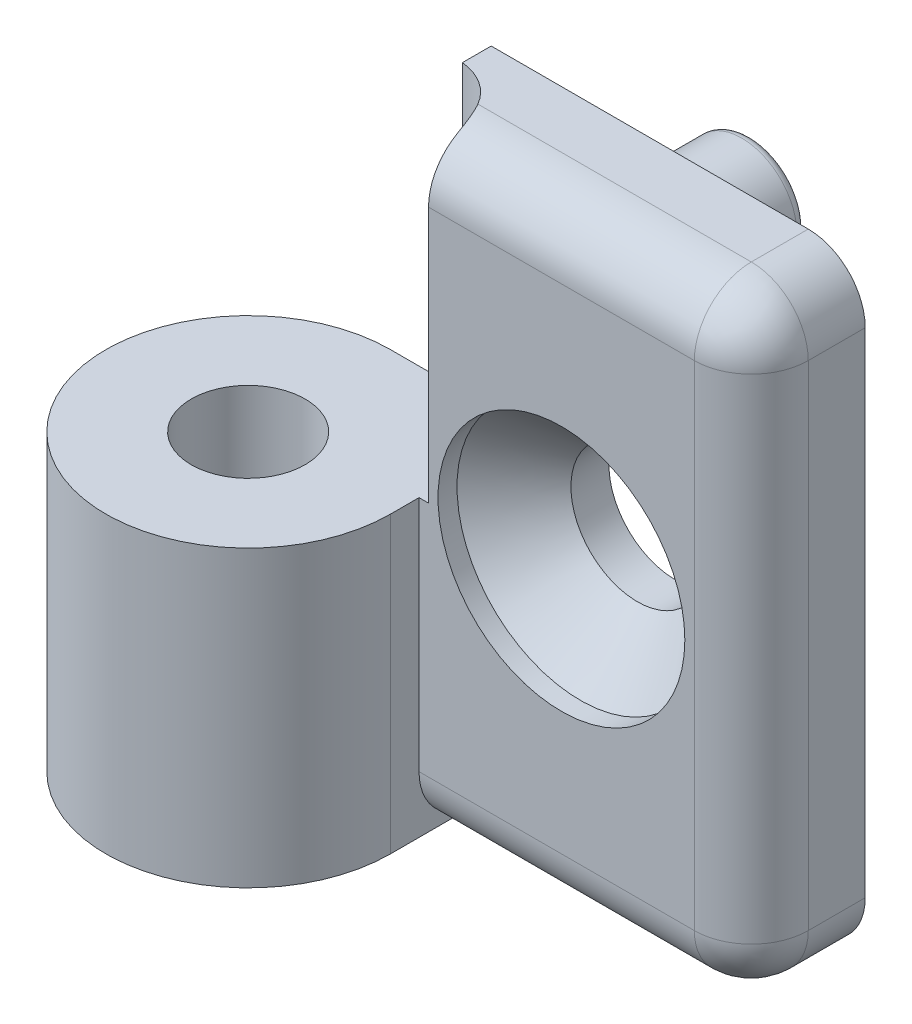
ISO-10303-21;
HEADER;
FILE_DESCRIPTION(('STEP AP214'),'2;1');
FILE_NAME('part.step','',(''),(''),'','','');
FILE_SCHEMA(('AUTOMOTIVE_DESIGN { 1 0 10303 214 1 1 1 1 }'));
ENDSEC;
DATA;
#1=APPLICATION_CONTEXT('core data for automotive mechanical design processes');
#2=APPLICATION_PROTOCOL_DEFINITION('international standard','automotive_design',2000,#1);
#3=PRODUCT_CONTEXT('',#1,'mechanical');
#4=PRODUCT('Part','Part','',(#3));
#5=PRODUCT_RELATED_PRODUCT_CATEGORY('part','',(#4));
#6=PRODUCT_DEFINITION_FORMATION('','',#4);
#7=PRODUCT_DEFINITION_CONTEXT('part definition',#1,'design');
#8=PRODUCT_DEFINITION('design','',#6,#7);
#9=PRODUCT_DEFINITION_SHAPE('','',#8);
#10=(LENGTH_UNIT() NAMED_UNIT(*) SI_UNIT(.MILLI.,.METRE.));
#11=(NAMED_UNIT(*) PLANE_ANGLE_UNIT() SI_UNIT($,.RADIAN.));
#12=(NAMED_UNIT(*) SI_UNIT($,.STERADIAN.) SOLID_ANGLE_UNIT());
#13=UNCERTAINTY_MEASURE_WITH_UNIT(LENGTH_MEASURE(1.E-05),#10,'distance_accuracy_value','');
#14=(GEOMETRIC_REPRESENTATION_CONTEXT(3) GLOBAL_UNCERTAINTY_ASSIGNED_CONTEXT((#13)) GLOBAL_UNIT_ASSIGNED_CONTEXT((#10,
#11,#12)) REPRESENTATION_CONTEXT('',''));
#15=CARTESIAN_POINT('',(0.,0.,0.));
#16=DIRECTION('',(0.,0.,1.));
#17=DIRECTION('',(1.,0.,0.));
#18=AXIS2_PLACEMENT_3D('',#15,#16,#17);
#19=CARTESIAN_POINT('',(7.59999999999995,15.5,-7.49999999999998));
#20=DIRECTION('',(0.,0.,1.));
#21=DIRECTION('',(1.,0.,0.));
#22=AXIS2_PLACEMENT_3D('',#19,#20,#21);
#23=PLANE('',#22);
#24=CARTESIAN_POINT('',(15.0000000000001,4.,-7.49999999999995));
#25=DIRECTION('',(0.,0.,1.));
#26=DIRECTION('',(1.,0.,0.));
#27=AXIS2_PLACEMENT_3D('',#24,#25,#26);
#28=CIRCLE('',#27,2.9);
#29=CARTESIAN_POINT('',(17.9000000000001,4.,-7.49999999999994));
#30=VERTEX_POINT('',#29);
#31=EDGE_CURVE('E262',#30,#30,#28,.F.);
#32=ORIENTED_EDGE('',*,*,#31,.F.);
#33=EDGE_LOOP('',(#32));
#34=FACE_BOUND('',#33,.T.);
#35=CARTESIAN_POINT('',(15.0000000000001,16.,-7.49999999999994));
#36=DIRECTION('',(0.,0.,1.));
#37=DIRECTION('',(1.,0.,0.));
#38=AXIS2_PLACEMENT_3D('',#35,#36,#37);
#39=CIRCLE('',#38,3.5);
#40=CARTESIAN_POINT('',(18.5000000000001,16.,-7.49999999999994));
#41=VERTEX_POINT('',#40);
#42=EDGE_CURVE('E171',#41,#41,#39,.T.);
#43=ORIENTED_EDGE('',*,*,#42,.T.);
#44=EDGE_LOOP('',(#43));
#45=FACE_BOUND('',#44,.T.);
#46=DIRECTION('',(0.,-1.,0.));
#47=VECTOR('',#46,1.);
#48=CARTESIAN_POINT('',(25.0000000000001,32.,-7.49999999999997));
#49=LINE('',#48,#47);
#50=CARTESIAN_POINT('',(25.0000000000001,29.,-7.49999999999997));
#51=VERTEX_POINT('',#50);
#52=CARTESIAN_POINT('',(25.0000000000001,3.,-7.49999999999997));
#53=VERTEX_POINT('',#52);
#54=EDGE_CURVE('E180',#51,#53,#49,.T.);
#55=ORIENTED_EDGE('',*,*,#54,.T.);
#56=CARTESIAN_POINT('',(22.0000000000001,3.,-7.49999999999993));
#57=DIRECTION('',(0.,0.,1.));
#58=DIRECTION('',(1.,0.,0.));
#59=AXIS2_PLACEMENT_3D('',#56,#57,#58);
#60=CIRCLE('',#59,3.);
#61=CARTESIAN_POINT('',(22.0000000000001,0.,-7.49999999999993));
#62=VERTEX_POINT('',#61);
#63=EDGE_CURVE('E222',#53,#62,#60,.F.);
#64=ORIENTED_EDGE('',*,*,#63,.T.);
#65=DIRECTION('',(-1.,0.,0.));
#66=VECTOR('',#65,1.);
#67=CARTESIAN_POINT('',(7.59999999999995,0.,-7.49999999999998));
#68=LINE('',#67,#66);
#69=CARTESIAN_POINT('',(0.,0.,-7.50000000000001));
#70=VERTEX_POINT('',#69);
#71=EDGE_CURVE('E198',#62,#70,#68,.T.);
#72=ORIENTED_EDGE('',*,*,#71,.T.);
#73=DIRECTION('',(0.,-1.,0.));
#74=VECTOR('',#73,1.);
#75=CARTESIAN_POINT('',(0.,15.5,-7.50000000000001));
#76=LINE('',#75,#74);
#77=CARTESIAN_POINT('',(0.,15.5,-7.50000000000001));
#78=VERTEX_POINT('',#77);
#79=EDGE_CURVE('E202',#78,#70,#76,.T.);
#80=ORIENTED_EDGE('',*,*,#79,.F.);
#81=DIRECTION('',(-1.,0.,0.));
#82=VECTOR('',#81,1.);
#83=CARTESIAN_POINT('',(7.59999999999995,15.5,-7.49999999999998));
#84=LINE('',#83,#82);
#85=CARTESIAN_POINT('',(5.30000000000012,15.5,-7.49999999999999));
#86=VERTEX_POINT('',#85);
#87=EDGE_CURVE('E200',#86,#78,#84,.T.);
#88=ORIENTED_EDGE('',*,*,#87,.F.);
#89=DIRECTION('',(0.,-1.,0.));
#90=VECTOR('',#89,1.);
#91=CARTESIAN_POINT('',(5.30000000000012,32.,-7.49999999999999));
#92=LINE('',#91,#90);
#93=CARTESIAN_POINT('',(5.30000000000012,32.,-7.49999999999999));
#94=VERTEX_POINT('',#93);
#95=EDGE_CURVE('E184',#94,#86,#92,.T.);
#96=ORIENTED_EDGE('',*,*,#95,.F.);
#97=DIRECTION('',(-1.,0.,0.));
#98=VECTOR('',#97,1.);
#99=CARTESIAN_POINT('',(0.,32.,-7.49999999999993));
#100=LINE('',#99,#98);
#101=CARTESIAN_POINT('',(22.0000000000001,32.,-7.49999999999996));
#102=VERTEX_POINT('',#101);
#103=EDGE_CURVE('E176',#102,#94,#100,.T.);
#104=ORIENTED_EDGE('',*,*,#103,.F.);
#105=CARTESIAN_POINT('',(22.0000000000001,29.,-7.49999999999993));
#106=DIRECTION('',(0.,0.,1.));
#107=DIRECTION('',(1.,0.,0.));
#108=AXIS2_PLACEMENT_3D('',#105,#106,#107);
#109=CIRCLE('',#108,3.);
#110=EDGE_CURVE('E220',#102,#51,#109,.F.);
#111=ORIENTED_EDGE('',*,*,#110,.T.);
#112=EDGE_LOOP('',(#55,#64,#72,#80,#88,#96,#104,#111));
#113=FACE_BOUND('',#112,.T.);
#114=CARTESIAN_POINT('',(15.0000000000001,28.,-7.49999999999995));
#115=DIRECTION('',(0.,0.,1.));
#116=DIRECTION('',(1.,0.,0.));
#117=AXIS2_PLACEMENT_3D('',#114,#115,#116);
#118=CIRCLE('',#117,2.9);
#119=CARTESIAN_POINT('',(17.9000000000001,28.,-7.49999999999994));
#120=VERTEX_POINT('',#119);
#121=EDGE_CURVE('E376',#120,#120,#118,.F.);
#122=ORIENTED_EDGE('',*,*,#121,.F.);
#123=EDGE_LOOP('',(#122));
#124=FACE_BOUND('',#123,.T.);
#125=ADVANCED_FACE('F34',(#34,#45,#113,#124),#23,.F.);
#126=CARTESIAN_POINT('',(0.,15.5,0.));
#127=DIRECTION('',(0.,-1.,0.));
#128=DIRECTION('',(0.,0.,-1.));
#129=AXIS2_PLACEMENT_3D('',#126,#127,#128);
#130=CYLINDRICAL_SURFACE('',#129,7.49999999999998);
#131=CARTESIAN_POINT('',(0.,0.,0.));
#132=DIRECTION('',(0.,1.,0.));
#133=DIRECTION('',(0.,0.,1.));
#134=AXIS2_PLACEMENT_3D('',#131,#132,#133);
#135=CIRCLE('',#134,7.49999999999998);
#136=CARTESIAN_POINT('',(7.49999999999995,0.,0.));
#137=VERTEX_POINT('',#136);
#138=EDGE_CURVE('E193',#70,#137,#135,.T.);
#139=ORIENTED_EDGE('',*,*,#138,.T.);
#140=DIRECTION('',(0.,-1.,0.));
#141=VECTOR('',#140,1.);
#142=CARTESIAN_POINT('',(7.49999999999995,15.5,0.));
#143=LINE('',#142,#141);
#144=CARTESIAN_POINT('',(7.49999999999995,15.5,0.));
#145=VERTEX_POINT('',#144);
#146=EDGE_CURVE('E212',#145,#137,#143,.T.);
#147=ORIENTED_EDGE('',*,*,#146,.F.);
#148=CARTESIAN_POINT('',(0.,15.5,0.));
#149=DIRECTION('',(0.,1.,0.));
#150=DIRECTION('',(0.,0.,1.));
#151=AXIS2_PLACEMENT_3D('',#148,#149,#150);
#152=CIRCLE('',#151,7.49999999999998);
#153=EDGE_CURVE('E194',#78,#145,#152,.T.);
#154=ORIENTED_EDGE('',*,*,#153,.F.);
#155=ORIENTED_EDGE('',*,*,#79,.T.);
#156=EDGE_LOOP('',(#139,#147,#154,#155));
#157=FACE_BOUND('',#156,.T.);
#158=ADVANCED_FACE('F312',(#157),#130,.T.);
#159=CARTESIAN_POINT('',(7.49999999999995,15.5,0.));
#160=DIRECTION('',(-1.,0.,0.));
#161=DIRECTION('',(0.,0.,1.));
#162=AXIS2_PLACEMENT_3D('',#159,#160,#161);
#163=PLANE('',#162);
#164=DIRECTION('',(0.,0.,-1.));
#165=VECTOR('',#164,1.);
#166=CARTESIAN_POINT('',(7.49999999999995,0.,0.));
#167=LINE('',#166,#165);
#168=CARTESIAN_POINT('',(7.49999999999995,0.,-4.49999999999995));
#169=VERTEX_POINT('',#168);
#170=EDGE_CURVE('E205',#137,#169,#167,.T.);
#171=ORIENTED_EDGE('',*,*,#170,.T.);
#172=CARTESIAN_POINT('',(7.49999999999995,3.,-4.49999999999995));
#173=DIRECTION('',(-1.,0.,0.));
#174=DIRECTION('',(0.,0.,1.));
#175=AXIS2_PLACEMENT_3D('',#172,#173,#174);
#176=CIRCLE('',#175,3.);
#177=CARTESIAN_POINT('',(7.49999999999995,3.,-1.49999999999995));
#178=VERTEX_POINT('',#177);
#179=EDGE_CURVE('E57',#169,#178,#176,.T.);
#180=ORIENTED_EDGE('',*,*,#179,.T.);
#181=DIRECTION('',(0.,-1.,0.));
#182=VECTOR('',#181,1.);
#183=CARTESIAN_POINT('',(7.49999999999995,15.5,-1.49999999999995));
#184=LINE('',#183,#182);
#185=CARTESIAN_POINT('',(7.49999999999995,15.5,-1.49999999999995));
#186=VERTEX_POINT('',#185);
#187=EDGE_CURVE('E210',#186,#178,#184,.T.);
#188=ORIENTED_EDGE('',*,*,#187,.F.);
#189=DIRECTION('',(0.,0.,-1.));
#190=VECTOR('',#189,1.);
#191=CARTESIAN_POINT('',(7.49999999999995,15.5,0.));
#192=LINE('',#191,#190);
#193=EDGE_CURVE('E197',#145,#186,#192,.T.);
#194=ORIENTED_EDGE('',*,*,#193,.F.);
#195=ORIENTED_EDGE('',*,*,#146,.T.);
#196=EDGE_LOOP('',(#171,#180,#188,#194,#195));
#197=FACE_BOUND('',#196,.T.);
#198=ADVANCED_FACE('F316',(#197),#163,.F.);
#199=CARTESIAN_POINT('',(7.59999999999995,15.5,-1.49999999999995));
#200=DIRECTION('',(0.,0.,-1.));
#201=DIRECTION('',(-1.,0.,0.));
#202=AXIS2_PLACEMENT_3D('',#199,#200,#201);
#203=PLANE('',#202);
#204=CARTESIAN_POINT('',(15.0000000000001,16.,-1.49999999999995));
#205=DIRECTION('',(0.,0.,1.));
#206=DIRECTION('',(1.,0.,0.));
#207=AXIS2_PLACEMENT_3D('',#204,#205,#206);
#208=CIRCLE('',#207,6.5);
#209=CARTESIAN_POINT('',(21.5000000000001,16.,-1.49999999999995));
#210=VERTEX_POINT('',#209);
#211=EDGE_CURVE('E161',#210,#210,#208,.T.);
#212=ORIENTED_EDGE('',*,*,#211,.F.);
#213=EDGE_LOOP('',(#212));
#214=FACE_BOUND('',#213,.T.);
#215=DIRECTION('',(-1.,0.,0.));
#216=VECTOR('',#215,1.);
#217=CARTESIAN_POINT('',(7.59999999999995,29.,-1.49999999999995));
#218=LINE('',#217,#216);
#219=CARTESIAN_POINT('',(22.0000000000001,29.,-1.49999999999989));
#220=VERTEX_POINT('',#219);
#221=CARTESIAN_POINT('',(8.00000000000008,29.,-1.49999999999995));
#222=VERTEX_POINT('',#221);
#223=EDGE_CURVE('E238',#220,#222,#218,.T.);
#224=ORIENTED_EDGE('',*,*,#223,.T.);
#225=DIRECTION('',(0.,-1.,0.));
#226=VECTOR('',#225,1.);
#227=CARTESIAN_POINT('',(8.00000000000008,15.5,-1.49999999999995));
#228=LINE('',#227,#226);
#229=CARTESIAN_POINT('',(8.00000000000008,15.5,-1.49999999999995));
#230=VERTEX_POINT('',#229);
#231=EDGE_CURVE('E49',#222,#230,#228,.T.);
#232=ORIENTED_EDGE('',*,*,#231,.T.);
#233=DIRECTION('',(1.,0.,0.));
#234=VECTOR('',#233,1.);
#235=CARTESIAN_POINT('',(7.59999999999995,15.5,-1.49999999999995));
#236=LINE('',#235,#234);
#237=EDGE_CURVE('E137',#186,#230,#236,.T.);
#238=ORIENTED_EDGE('',*,*,#237,.F.);
#239=ORIENTED_EDGE('',*,*,#187,.T.);
#240=DIRECTION('',(1.,0.,0.));
#241=VECTOR('',#240,1.);
#242=CARTESIAN_POINT('',(7.59999999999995,3.,-1.49999999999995));
#243=LINE('',#242,#241);
#244=CARTESIAN_POINT('',(22.0000000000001,3.,-1.49999999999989));
#245=VERTEX_POINT('',#244);
#246=EDGE_CURVE('E241',#178,#245,#243,.T.);
#247=ORIENTED_EDGE('',*,*,#246,.T.);
#248=DIRECTION('',(0.,-1.,0.));
#249=VECTOR('',#248,1.);
#250=CARTESIAN_POINT('',(22.0000000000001,32.,-1.49999999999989));
#251=LINE('',#250,#249);
#252=EDGE_CURVE('E187',#220,#245,#251,.T.);
#253=ORIENTED_EDGE('',*,*,#252,.F.);
#254=EDGE_LOOP('',(#224,#232,#238,#239,#247,#253));
#255=FACE_BOUND('',#254,.T.);
#256=ADVANCED_FACE('F305',(#214,#255),#203,.F.);
#257=CARTESIAN_POINT('',(0.,15.5,0.));
#258=DIRECTION('',(0.,1.,0.));
#259=DIRECTION('',(0.,0.,1.));
#260=AXIS2_PLACEMENT_3D('',#257,#258,#259);
#261=PLANE('',#260);
#262=CARTESIAN_POINT('',(0.,15.5,0.));
#263=DIRECTION('',(0.,1.,0.));
#264=DIRECTION('',(0.,0.,1.));
#265=AXIS2_PLACEMENT_3D('',#262,#263,#264);
#266=CIRCLE('',#265,3.);
#267=CARTESIAN_POINT('',(0.,15.5,3.));
#268=VERTEX_POINT('',#267);
#269=EDGE_CURVE('E154',#268,#268,#266,.T.);
#270=ORIENTED_EDGE('',*,*,#269,.F.);
#271=EDGE_LOOP('',(#270));
#272=FACE_BOUND('',#271,.T.);
#273=ORIENTED_EDGE('',*,*,#193,.T.);
#274=ORIENTED_EDGE('',*,*,#237,.T.);
#275=DIRECTION('',(0.,0.,-1.));
#276=VECTOR('',#275,1.);
#277=CARTESIAN_POINT('',(8.00000000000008,15.5,-2.99999999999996));
#278=LINE('',#277,#276);
#279=CARTESIAN_POINT('',(8.00000000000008,15.5,-2.99999999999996));
#280=VERTEX_POINT('',#279);
#281=EDGE_CURVE('E130',#230,#280,#278,.T.);
#282=ORIENTED_EDGE('',*,*,#281,.T.);
#283=CARTESIAN_POINT('',(5.00000000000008,15.5,-2.99999999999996));
#284=DIRECTION('',(0.,1.,0.));
#285=DIRECTION('',(0.,0.,1.));
#286=AXIS2_PLACEMENT_3D('',#283,#284,#285);
#287=CIRCLE('',#286,3.);
#288=CARTESIAN_POINT('',(5.30000000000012,15.5,-5.98496231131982));
#289=VERTEX_POINT('',#288);
#290=EDGE_CURVE('E135',#280,#289,#287,.T.);
#291=ORIENTED_EDGE('',*,*,#290,.T.);
#292=DIRECTION('',(0.,0.,1.));
#293=VECTOR('',#292,1.);
#294=CARTESIAN_POINT('',(5.30000000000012,15.5,0.));
#295=LINE('',#294,#293);
#296=EDGE_CURVE('E183',#86,#289,#295,.T.);
#297=ORIENTED_EDGE('',*,*,#296,.F.);
#298=ORIENTED_EDGE('',*,*,#87,.T.);
#299=ORIENTED_EDGE('',*,*,#153,.T.);
#300=EDGE_LOOP('',(#273,#274,#282,#291,#297,#298,#299));
#301=FACE_BOUND('',#300,.T.);
#302=ADVANCED_FACE('F133',(#272,#301),#261,.T.);
#303=CARTESIAN_POINT('',(0.,0.,0.));
#304=DIRECTION('',(0.,1.,0.));
#305=DIRECTION('',(0.,0.,1.));
#306=AXIS2_PLACEMENT_3D('',#303,#304,#305);
#307=PLANE('',#306);
#308=ORIENTED_EDGE('',*,*,#71,.F.);
#309=DIRECTION('',(0.,0.,-1.));
#310=VECTOR('',#309,1.);
#311=CARTESIAN_POINT('',(22.0000000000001,0.,0.));
#312=LINE('',#311,#310);
#313=CARTESIAN_POINT('',(22.0000000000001,0.,-4.49999999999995));
#314=VERTEX_POINT('',#313);
#315=EDGE_CURVE('E227',#62,#314,#312,.F.);
#316=ORIENTED_EDGE('',*,*,#315,.T.);
#317=DIRECTION('',(1.,0.,0.));
#318=VECTOR('',#317,1.);
#319=CARTESIAN_POINT('',(0.,0.,-4.49999999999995));
#320=LINE('',#319,#318);
#321=EDGE_CURVE('E224',#314,#169,#320,.F.);
#322=ORIENTED_EDGE('',*,*,#321,.T.);
#323=ORIENTED_EDGE('',*,*,#170,.F.);
#324=ORIENTED_EDGE('',*,*,#138,.F.);
#325=EDGE_LOOP('',(#308,#316,#322,#323,#324));
#326=FACE_BOUND('',#325,.T.);
#327=ADVANCED_FACE('F301',(#326),#307,.F.);
#328=CARTESIAN_POINT('',(25.0000000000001,32.,0.));
#329=DIRECTION('',(-1.,0.,0.));
#330=DIRECTION('',(0.,0.,1.));
#331=AXIS2_PLACEMENT_3D('',#328,#329,#330);
#332=PLANE('',#331);
#333=DIRECTION('',(0.,-1.,0.));
#334=VECTOR('',#333,1.);
#335=CARTESIAN_POINT('',(25.0000000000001,32.,-4.49999999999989));
#336=LINE('',#335,#334);
#337=CARTESIAN_POINT('',(25.0000000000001,29.,-4.49999999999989));
#338=VERTEX_POINT('',#337);
#339=CARTESIAN_POINT('',(25.0000000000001,3.,-4.49999999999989));
#340=VERTEX_POINT('',#339);
#341=EDGE_CURVE('E179',#338,#340,#336,.T.);
#342=ORIENTED_EDGE('',*,*,#341,.T.);
#343=DIRECTION('',(0.,0.,-1.));
#344=VECTOR('',#343,1.);
#345=CARTESIAN_POINT('',(25.0000000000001,3.,0.));
#346=LINE('',#345,#344);
#347=EDGE_CURVE('E217',#340,#53,#346,.T.);
#348=ORIENTED_EDGE('',*,*,#347,.T.);
#349=ORIENTED_EDGE('',*,*,#54,.F.);
#350=DIRECTION('',(0.,0.,-1.));
#351=VECTOR('',#350,1.);
#352=CARTESIAN_POINT('',(25.0000000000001,29.,0.));
#353=LINE('',#352,#351);
#354=EDGE_CURVE('E215',#51,#338,#353,.F.);
#355=ORIENTED_EDGE('',*,*,#354,.T.);
#356=EDGE_LOOP('',(#342,#348,#349,#355));
#357=FACE_BOUND('',#356,.T.);
#358=ADVANCED_FACE('F294',(#357),#332,.F.);
#359=CARTESIAN_POINT('',(5.30000000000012,32.,0.));
#360=DIRECTION('',(-1.,0.,0.));
#361=DIRECTION('',(0.,0.,1.));
#362=AXIS2_PLACEMENT_3D('',#359,#360,#361);
#363=PLANE('',#362);
#364=DIRECTION('',(0.,1.,0.));
#365=VECTOR('',#364,1.);
#366=CARTESIAN_POINT('',(5.30000000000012,15.5,-5.98496231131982));
#367=LINE('',#366,#365);
#368=CARTESIAN_POINT('',(5.30000000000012,32.,-5.98496231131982));
#369=VERTEX_POINT('',#368);
#370=EDGE_CURVE('E148',#369,#289,#367,.F.);
#371=ORIENTED_EDGE('',*,*,#370,.F.);
#372=DIRECTION('',(0.,0.,-1.));
#373=VECTOR('',#372,1.);
#374=CARTESIAN_POINT('',(5.30000000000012,32.,0.));
#375=LINE('',#374,#373);
#376=EDGE_CURVE('E174',#369,#94,#375,.T.);
#377=ORIENTED_EDGE('',*,*,#376,.T.);
#378=ORIENTED_EDGE('',*,*,#95,.T.);
#379=ORIENTED_EDGE('',*,*,#296,.T.);
#380=EDGE_LOOP('',(#371,#377,#378,#379));
#381=FACE_BOUND('',#380,.T.);
#382=ADVANCED_FACE('F291',(#381),#363,.T.);
#383=CARTESIAN_POINT('',(22.0000000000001,32.,-4.49999999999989));
#384=DIRECTION('',(0.,-1.,0.));
#385=DIRECTION('',(0.,0.,-1.));
#386=AXIS2_PLACEMENT_3D('',#383,#384,#385);
#387=CYLINDRICAL_SURFACE('',#386,3.);
#388=ORIENTED_EDGE('',*,*,#252,.T.);
#389=CARTESIAN_POINT('',(22.0000000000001,3.,-4.49999999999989));
#390=DIRECTION('',(0.,-1.,0.));
#391=DIRECTION('',(0.,0.,-1.));
#392=AXIS2_PLACEMENT_3D('',#389,#390,#391);
#393=CIRCLE('',#392,3.);
#394=EDGE_CURVE('E231',#245,#340,#393,.F.);
#395=ORIENTED_EDGE('',*,*,#394,.T.);
#396=ORIENTED_EDGE('',*,*,#341,.F.);
#397=CARTESIAN_POINT('',(22.0000000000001,29.,-4.49999999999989));
#398=DIRECTION('',(0.,-1.,0.));
#399=DIRECTION('',(0.,0.,-1.));
#400=AXIS2_PLACEMENT_3D('',#397,#398,#399);
#401=CIRCLE('',#400,3.);
#402=EDGE_CURVE('E229',#338,#220,#401,.T.);
#403=ORIENTED_EDGE('',*,*,#402,.T.);
#404=EDGE_LOOP('',(#388,#395,#396,#403));
#405=FACE_BOUND('',#404,.T.);
#406=ADVANCED_FACE('F289',(#405),#387,.T.);
#407=CARTESIAN_POINT('',(0.,32.,0.));
#408=DIRECTION('',(0.,-1.,0.));
#409=DIRECTION('',(0.,0.,-1.));
#410=AXIS2_PLACEMENT_3D('',#407,#408,#409);
#411=PLANE('',#410);
#412=ORIENTED_EDGE('',*,*,#376,.F.);
#413=CARTESIAN_POINT('',(5.00000000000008,32.,-2.99999999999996));
#414=DIRECTION('',(0.,1.,0.));
#415=DIRECTION('',(0.,0.,1.));
#416=AXIS2_PLACEMENT_3D('',#413,#414,#415);
#417=CIRCLE('',#416,3.);
#418=CARTESIAN_POINT('',(7.5980762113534,32.,-4.49999999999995));
#419=VERTEX_POINT('',#418);
#420=EDGE_CURVE('E149',#419,#369,#417,.T.);
#421=ORIENTED_EDGE('',*,*,#420,.F.);
#422=DIRECTION('',(-1.,0.,0.));
#423=VECTOR('',#422,1.);
#424=CARTESIAN_POINT('',(0.,32.,-4.49999999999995));
#425=LINE('',#424,#423);
#426=CARTESIAN_POINT('',(22.0000000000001,32.,-4.49999999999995));
#427=VERTEX_POINT('',#426);
#428=EDGE_CURVE('E233',#419,#427,#425,.F.);
#429=ORIENTED_EDGE('',*,*,#428,.T.);
#430=DIRECTION('',(0.,0.,-1.));
#431=VECTOR('',#430,1.);
#432=CARTESIAN_POINT('',(22.0000000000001,32.,0.));
#433=LINE('',#432,#431);
#434=EDGE_CURVE('E235',#427,#102,#433,.T.);
#435=ORIENTED_EDGE('',*,*,#434,.T.);
#436=ORIENTED_EDGE('',*,*,#103,.T.);
#437=EDGE_LOOP('',(#412,#421,#429,#435,#436));
#438=FACE_BOUND('',#437,.T.);
#439=ADVANCED_FACE('F285',(#438),#411,.F.);
#440=CARTESIAN_POINT('',(15.0000000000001,16.,-1.49999999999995));
#441=DIRECTION('',(0.,0.,1.));
#442=DIRECTION('',(1.,0.,0.));
#443=AXIS2_PLACEMENT_3D('',#440,#441,#442);
#444=CYLINDRICAL_SURFACE('',#443,3.5);
#445=ORIENTED_EDGE('',*,*,#42,.F.);
#446=EDGE_LOOP('',(#445));
#447=FACE_BOUND('',#446,.T.);
#448=CARTESIAN_POINT('',(15.0000000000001,16.,-5.49999999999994));
#449=DIRECTION('',(0.,0.,1.));
#450=DIRECTION('',(1.,0.,0.));
#451=AXIS2_PLACEMENT_3D('',#448,#449,#450);
#452=CIRCLE('',#451,3.5);
#453=CARTESIAN_POINT('',(18.5000000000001,16.,-5.49999999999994));
#454=VERTEX_POINT('',#453);
#455=EDGE_CURVE('E168',#454,#454,#452,.T.);
#456=ORIENTED_EDGE('',*,*,#455,.T.);
#457=EDGE_LOOP('',(#456));
#458=FACE_BOUND('',#457,.T.);
#459=ADVANCED_FACE('F281',(#447,#458),#444,.F.);
#460=CARTESIAN_POINT('',(15.0000000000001,16.,-2.49999999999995));
#461=DIRECTION('',(0.,0.,1.));
#462=DIRECTION('',(1.,0.,0.));
#463=AXIS2_PLACEMENT_3D('',#460,#461,#462);
#464=CONICAL_SURFACE('',#463,6.5,0.785398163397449);
#465=ORIENTED_EDGE('',*,*,#455,.F.);
#466=EDGE_LOOP('',(#465));
#467=FACE_BOUND('',#466,.T.);
#468=CARTESIAN_POINT('',(15.0000000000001,16.,-2.49999999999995));
#469=DIRECTION('',(0.,0.,1.));
#470=DIRECTION('',(1.,0.,0.));
#471=AXIS2_PLACEMENT_3D('',#468,#469,#470);
#472=CIRCLE('',#471,6.5);
#473=CARTESIAN_POINT('',(21.5000000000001,16.,-2.49999999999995));
#474=VERTEX_POINT('',#473);
#475=EDGE_CURVE('E164',#474,#474,#472,.T.);
#476=ORIENTED_EDGE('',*,*,#475,.T.);
#477=EDGE_LOOP('',(#476));
#478=FACE_BOUND('',#477,.T.);
#479=ADVANCED_FACE('F277',(#467,#478),#464,.F.);
#480=CARTESIAN_POINT('',(15.0000000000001,16.,-1.49999999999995));
#481=DIRECTION('',(0.,0.,1.));
#482=DIRECTION('',(1.,0.,0.));
#483=AXIS2_PLACEMENT_3D('',#480,#481,#482);
#484=CYLINDRICAL_SURFACE('',#483,6.5);
#485=ORIENTED_EDGE('',*,*,#475,.F.);
#486=EDGE_LOOP('',(#485));
#487=FACE_BOUND('',#486,.T.);
#488=ORIENTED_EDGE('',*,*,#211,.T.);
#489=EDGE_LOOP('',(#488));
#490=FACE_BOUND('',#489,.T.);
#491=ADVANCED_FACE('F273',(#487,#490),#484,.F.);
#492=CARTESIAN_POINT('',(7.59999999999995,3.,-4.49999999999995));
#493=DIRECTION('',(1.,0.,0.));
#494=DIRECTION('',(0.,0.,-1.));
#495=AXIS2_PLACEMENT_3D('',#492,#493,#494);
#496=CYLINDRICAL_SURFACE('',#495,3.);
#497=CARTESIAN_POINT('',(22.0000000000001,3.,-4.49999999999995));
#498=DIRECTION('',(1.,0.,0.));
#499=DIRECTION('',(0.,0.,-1.));
#500=AXIS2_PLACEMENT_3D('',#497,#498,#499);
#501=CIRCLE('',#500,3.);
#502=EDGE_CURVE('E165',#245,#314,#501,.T.);
#503=ORIENTED_EDGE('',*,*,#502,.F.);
#504=ORIENTED_EDGE('',*,*,#246,.F.);
#505=ORIENTED_EDGE('',*,*,#179,.F.);
#506=ORIENTED_EDGE('',*,*,#321,.F.);
#507=EDGE_LOOP('',(#503,#504,#505,#506));
#508=FACE_BOUND('',#507,.T.);
#509=ADVANCED_FACE('F276',(#508),#496,.T.);
#510=CARTESIAN_POINT('',(22.0000000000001,3.,-4.49999999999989));
#511=DIRECTION('',(0.,0.,1.));
#512=DIRECTION('',(1.,0.,0.));
#513=AXIS2_PLACEMENT_3D('',#510,#511,#512);
#514=SPHERICAL_SURFACE('',#513,3.);
#515=ORIENTED_EDGE('',*,*,#394,.F.);
#516=ORIENTED_EDGE('',*,*,#502,.T.);
#517=CARTESIAN_POINT('',(22.0000000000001,3.,-4.49999999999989));
#518=DIRECTION('',(0.,0.,-1.));
#519=DIRECTION('',(-1.,0.,0.));
#520=AXIS2_PLACEMENT_3D('',#517,#518,#519);
#521=CIRCLE('',#520,3.);
#522=EDGE_CURVE('E244',#340,#314,#521,.T.);
#523=ORIENTED_EDGE('',*,*,#522,.F.);
#524=EDGE_LOOP('',(#515,#516,#523));
#525=FACE_BOUND('',#524,.T.);
#526=ADVANCED_FACE('F326',(#525),#514,.T.);
#527=CARTESIAN_POINT('',(22.0000000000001,3.,0.));
#528=DIRECTION('',(0.,0.,-1.));
#529=DIRECTION('',(-1.,0.,0.));
#530=AXIS2_PLACEMENT_3D('',#527,#528,#529);
#531=CYLINDRICAL_SURFACE('',#530,3.);
#532=ORIENTED_EDGE('',*,*,#522,.T.);
#533=ORIENTED_EDGE('',*,*,#315,.F.);
#534=ORIENTED_EDGE('',*,*,#63,.F.);
#535=ORIENTED_EDGE('',*,*,#347,.F.);
#536=EDGE_LOOP('',(#532,#533,#534,#535));
#537=FACE_BOUND('',#536,.T.);
#538=ADVANCED_FACE('F323',(#537),#531,.T.);
#539=CARTESIAN_POINT('',(7.59999999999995,29.,-4.49999999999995));
#540=DIRECTION('',(-1.,0.,0.));
#541=DIRECTION('',(0.,0.,1.));
#542=AXIS2_PLACEMENT_3D('',#539,#540,#541);
#543=CYLINDRICAL_SURFACE('',#542,3.);
#544=CARTESIAN_POINT('',(8.00000000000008,31.5980762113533,-2.99999999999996));
#545=CARTESIAN_POINT('',(8.00000873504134,31.6298815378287,-3.05506575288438));
#546=CARTESIAN_POINT('',(7.99848380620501,31.6599225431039,-3.1111644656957));
#547=CARTESIAN_POINT('',(7.99209041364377,31.716329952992,-3.22502077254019));
#548=CARTESIAN_POINT('',(7.98722061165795,31.7426948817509,-3.28277902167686));
#549=CARTESIAN_POINT('',(7.97386246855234,31.7915724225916,-3.399488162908));
#550=CARTESIAN_POINT('',(7.96537502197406,31.8140859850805,-3.45843875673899));
#551=CARTESIAN_POINT('',(7.94460358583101,31.8551763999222,-3.57700938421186));
#552=CARTESIAN_POINT('',(7.93232041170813,31.8737540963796,-3.6366292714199));
#553=CARTESIAN_POINT('',(7.889492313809,31.9236220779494,-3.81603625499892));
#554=CARTESIAN_POINT('',(7.85299179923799,31.9489585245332,-3.93615603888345));
#555=CARTESIAN_POINT('',(7.76429029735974,31.9844539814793,-4.17243161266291));
#556=CARTESIAN_POINT('',(7.71212709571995,31.994649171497,-4.28859620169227));
#557=CARTESIAN_POINT('',(7.64399140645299,31.9989159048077,-4.41762815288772));
#558=CARTESIAN_POINT('',(7.63502245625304,31.9993247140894,-4.43422971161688));
#559=CARTESIAN_POINT('',(7.61677934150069,31.9998663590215,-4.46724885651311));
#560=CARTESIAN_POINT('',(7.60750546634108,31.9999994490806,-4.48366659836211));
#561=CARTESIAN_POINT('',(7.5980762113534,32.,-4.49999999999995));
#562=B_SPLINE_CURVE_WITH_KNOTS('',3,(#544,#545,#546,#547,#548,#549,#550,#551,#552,#553,#554,
#555,#556,#557,#558,#559,#560,#561),.UNSPECIFIED.,.F.,.F.,(4,2,2,2,2,2,2,2,4),(0.,
0.190739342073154,0.381555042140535,0.57232358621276,0.763051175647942,1.14519682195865,
1.52642786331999,1.58304875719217,1.63961738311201),.UNSPECIFIED.);
#563=CARTESIAN_POINT('',(8.00000000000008,31.5980762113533,-2.99999999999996));
#564=VERTEX_POINT('',#563);
#565=EDGE_CURVE('E255',#564,#419,#562,.T.);
#566=ORIENTED_EDGE('',*,*,#565,.F.);
#567=CARTESIAN_POINT('',(8.00000000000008,29.,-4.49999999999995));
#568=DIRECTION('',(1.,0.,0.));
#569=DIRECTION('',(0.,0.,-1.));
#570=AXIS2_PLACEMENT_3D('',#567,#568,#569);
#571=CIRCLE('',#570,3.);
#572=EDGE_CURVE('E142',#222,#564,#571,.F.);
#573=ORIENTED_EDGE('',*,*,#572,.F.);
#574=ORIENTED_EDGE('',*,*,#223,.F.);
#575=CARTESIAN_POINT('',(22.0000000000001,29.,-4.49999999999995));
#576=DIRECTION('',(1.,0.,0.));
#577=DIRECTION('',(0.,0.,-1.));
#578=AXIS2_PLACEMENT_3D('',#575,#576,#577);
#579=CIRCLE('',#578,3.);
#580=EDGE_CURVE('E247',#427,#220,#579,.T.);
#581=ORIENTED_EDGE('',*,*,#580,.F.);
#582=ORIENTED_EDGE('',*,*,#428,.F.);
#583=EDGE_LOOP('',(#566,#573,#574,#581,#582));
#584=FACE_BOUND('',#583,.T.);
#585=ADVANCED_FACE('F264',(#584),#543,.T.);
#586=CARTESIAN_POINT('',(22.0000000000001,29.,-4.49999999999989));
#587=DIRECTION('',(0.,0.,1.));
#588=DIRECTION('',(1.,0.,0.));
#589=AXIS2_PLACEMENT_3D('',#586,#587,#588);
#590=SPHERICAL_SURFACE('',#589,3.);
#591=ORIENTED_EDGE('',*,*,#580,.T.);
#592=ORIENTED_EDGE('',*,*,#402,.F.);
#593=CARTESIAN_POINT('',(22.0000000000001,29.,-4.49999999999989));
#594=DIRECTION('',(0.,0.,-1.));
#595=DIRECTION('',(-1.,0.,0.));
#596=AXIS2_PLACEMENT_3D('',#593,#594,#595);
#597=CIRCLE('',#596,3.);
#598=EDGE_CURVE('E160',#427,#338,#597,.T.);
#599=ORIENTED_EDGE('',*,*,#598,.F.);
#600=EDGE_LOOP('',(#591,#592,#599));
#601=FACE_BOUND('',#600,.T.);
#602=ADVANCED_FACE('F336',(#601),#590,.T.);
#603=CARTESIAN_POINT('',(22.0000000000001,29.,0.));
#604=DIRECTION('',(0.,0.,-1.));
#605=DIRECTION('',(-1.,0.,0.));
#606=AXIS2_PLACEMENT_3D('',#603,#604,#605);
#607=CYLINDRICAL_SURFACE('',#606,3.);
#608=ORIENTED_EDGE('',*,*,#598,.T.);
#609=ORIENTED_EDGE('',*,*,#354,.F.);
#610=ORIENTED_EDGE('',*,*,#110,.F.);
#611=ORIENTED_EDGE('',*,*,#434,.F.);
#612=EDGE_LOOP('',(#608,#609,#610,#611));
#613=FACE_BOUND('',#612,.T.);
#614=ADVANCED_FACE('F334',(#613),#607,.T.);
#615=CARTESIAN_POINT('',(8.00000000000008,15.5,-2.99999999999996));
#616=DIRECTION('',(1.,0.,0.));
#617=DIRECTION('',(0.,0.,-1.));
#618=AXIS2_PLACEMENT_3D('',#615,#616,#617);
#619=PLANE('',#618);
#620=ORIENTED_EDGE('',*,*,#572,.T.);
#621=DIRECTION('',(0.,1.,0.));
#622=VECTOR('',#621,1.);
#623=CARTESIAN_POINT('',(8.00000000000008,15.5,-2.99999999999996));
#624=LINE('',#623,#622);
#625=EDGE_CURVE('E138',#280,#564,#624,.T.);
#626=ORIENTED_EDGE('',*,*,#625,.F.);
#627=ORIENTED_EDGE('',*,*,#281,.F.);
#628=ORIENTED_EDGE('',*,*,#231,.F.);
#629=EDGE_LOOP('',(#620,#626,#627,#628));
#630=FACE_BOUND('',#629,.T.);
#631=ADVANCED_FACE('F141',(#630),#619,.F.);
#632=CARTESIAN_POINT('',(5.00000000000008,15.5,-2.99999999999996));
#633=DIRECTION('',(0.,1.,0.));
#634=DIRECTION('',(0.,0.,1.));
#635=AXIS2_PLACEMENT_3D('',#632,#633,#634);
#636=CYLINDRICAL_SURFACE('',#635,3.);
#637=ORIENTED_EDGE('',*,*,#370,.T.);
#638=ORIENTED_EDGE('',*,*,#290,.F.);
#639=ORIENTED_EDGE('',*,*,#625,.T.);
#640=ORIENTED_EDGE('',*,*,#565,.T.);
#641=ORIENTED_EDGE('',*,*,#420,.T.);
#642=EDGE_LOOP('',(#637,#638,#639,#640,#641));
#643=FACE_BOUND('',#642,.T.);
#644=ADVANCED_FACE('F146',(#643),#636,.F.);
#645=CARTESIAN_POINT('',(0.,2.,0.));
#646=DIRECTION('',(0.,1.,0.));
#647=DIRECTION('',(0.,0.,1.));
#648=AXIS2_PLACEMENT_3D('',#645,#646,#647);
#649=CYLINDRICAL_SURFACE('',#648,3.);
#650=CARTESIAN_POINT('',(0.,2.,0.));
#651=DIRECTION('',(0.,1.,0.));
#652=DIRECTION('',(0.,0.,1.));
#653=AXIS2_PLACEMENT_3D('',#650,#651,#652);
#654=CIRCLE('',#653,3.);
#655=CARTESIAN_POINT('',(0.,2.,3.));
#656=VERTEX_POINT('',#655);
#657=EDGE_CURVE('E151',#656,#656,#654,.T.);
#658=ORIENTED_EDGE('',*,*,#657,.F.);
#659=EDGE_LOOP('',(#658));
#660=FACE_BOUND('',#659,.T.);
#661=ORIENTED_EDGE('',*,*,#269,.T.);
#662=EDGE_LOOP('',(#661));
#663=FACE_BOUND('',#662,.T.);
#664=ADVANCED_FACE('F271',(#660,#663),#649,.F.);
#665=CARTESIAN_POINT('',(0.,2.,0.));
#666=DIRECTION('',(0.,1.,0.));
#667=DIRECTION('',(0.,0.,1.));
#668=AXIS2_PLACEMENT_3D('',#665,#666,#667);
#669=PLANE('',#668);
#670=ORIENTED_EDGE('',*,*,#657,.T.);
#671=EDGE_LOOP('',(#670));
#672=FACE_BOUND('',#671,.T.);
#673=ADVANCED_FACE('F420',(#672),#669,.T.);
#674=CARTESIAN_POINT('',(15.0000000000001,4.,-11.5));
#675=DIRECTION('',(0.,0.,1.));
#676=DIRECTION('',(1.,0.,0.));
#677=AXIS2_PLACEMENT_3D('',#674,#675,#676);
#678=CYLINDRICAL_SURFACE('',#677,2.9);
#679=CARTESIAN_POINT('',(15.0000000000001,4.,-11.));
#680=DIRECTION('',(0.,0.,-1.));
#681=DIRECTION('',(-1.,0.,0.));
#682=AXIS2_PLACEMENT_3D('',#679,#680,#681);
#683=CIRCLE('',#682,2.9);
#684=CARTESIAN_POINT('',(12.1000000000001,4.,-11.));
#685=VERTEX_POINT('',#684);
#686=EDGE_CURVE('E380',#685,#685,#683,.F.);
#687=ORIENTED_EDGE('',*,*,#686,.T.);
#688=EDGE_LOOP('',(#687));
#689=FACE_BOUND('',#688,.T.);
#690=ORIENTED_EDGE('',*,*,#31,.T.);
#691=EDGE_LOOP('',(#690));
#692=FACE_BOUND('',#691,.T.);
#693=ADVANCED_FACE('F414',(#689,#692),#678,.T.);
#694=CARTESIAN_POINT('',(15.0000000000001,4.,-11.5));
#695=DIRECTION('',(0.,0.,-1.));
#696=DIRECTION('',(-1.,0.,0.));
#697=AXIS2_PLACEMENT_3D('',#694,#695,#696);
#698=PLANE('',#697);
#699=CARTESIAN_POINT('',(15.0000000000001,4.,-11.5));
#700=DIRECTION('',(0.,0.,-1.));
#701=DIRECTION('',(-1.,0.,0.));
#702=AXIS2_PLACEMENT_3D('',#699,#700,#701);
#703=CIRCLE('',#702,2.);
#704=CARTESIAN_POINT('',(13.0000000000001,4.,-11.5));
#705=VERTEX_POINT('',#704);
#706=EDGE_CURVE('E443',#705,#705,#703,.T.);
#707=ORIENTED_EDGE('',*,*,#706,.F.);
#708=EDGE_LOOP('',(#707));
#709=FACE_BOUND('',#708,.T.);
#710=CARTESIAN_POINT('',(15.0000000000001,4.,-11.5));
#711=DIRECTION('',(0.,0.,-1.));
#712=DIRECTION('',(-1.,0.,0.));
#713=AXIS2_PLACEMENT_3D('',#710,#711,#712);
#714=CIRCLE('',#713,2.4);
#715=CARTESIAN_POINT('',(12.6000000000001,4.,-11.5));
#716=VERTEX_POINT('',#715);
#717=EDGE_CURVE('E378',#716,#716,#714,.T.);
#718=ORIENTED_EDGE('',*,*,#717,.T.);
#719=EDGE_LOOP('',(#718));
#720=FACE_BOUND('',#719,.T.);
#721=ADVANCED_FACE('F406',(#709,#720),#698,.T.);
#722=CARTESIAN_POINT('',(15.0000000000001,28.,-11.5));
#723=DIRECTION('',(0.,0.,1.));
#724=DIRECTION('',(1.,0.,0.));
#725=AXIS2_PLACEMENT_3D('',#722,#723,#724);
#726=CYLINDRICAL_SURFACE('',#725,2.9);
#727=CARTESIAN_POINT('',(15.0000000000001,28.,-11.));
#728=DIRECTION('',(0.,0.,-1.));
#729=DIRECTION('',(-1.,0.,0.));
#730=AXIS2_PLACEMENT_3D('',#727,#728,#729);
#731=CIRCLE('',#730,2.9);
#732=CARTESIAN_POINT('',(12.1000000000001,28.,-11.));
#733=VERTEX_POINT('',#732);
#734=EDGE_CURVE('E11',#733,#733,#731,.F.);
#735=ORIENTED_EDGE('',*,*,#734,.T.);
#736=EDGE_LOOP('',(#735));
#737=FACE_BOUND('',#736,.T.);
#738=ORIENTED_EDGE('',*,*,#121,.T.);
#739=EDGE_LOOP('',(#738));
#740=FACE_BOUND('',#739,.T.);
#741=ADVANCED_FACE('F404',(#737,#740),#726,.T.);
#742=CARTESIAN_POINT('',(15.0000000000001,28.,-11.5));
#743=DIRECTION('',(0.,0.,-1.));
#744=DIRECTION('',(-1.,0.,0.));
#745=AXIS2_PLACEMENT_3D('',#742,#743,#744);
#746=PLANE('',#745);
#747=CARTESIAN_POINT('',(15.0000000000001,28.,-11.5));
#748=DIRECTION('',(0.,0.,-1.));
#749=DIRECTION('',(-1.,0.,0.));
#750=AXIS2_PLACEMENT_3D('',#747,#748,#749);
#751=CIRCLE('',#750,2.);
#752=CARTESIAN_POINT('',(13.0000000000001,28.,-11.5));
#753=VERTEX_POINT('',#752);
#754=EDGE_CURVE('E435',#753,#753,#751,.T.);
#755=ORIENTED_EDGE('',*,*,#754,.F.);
#756=EDGE_LOOP('',(#755));
#757=FACE_BOUND('',#756,.T.);
#758=CARTESIAN_POINT('',(15.0000000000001,28.,-11.5));
#759=DIRECTION('',(0.,0.,-1.));
#760=DIRECTION('',(-1.,0.,0.));
#761=AXIS2_PLACEMENT_3D('',#758,#759,#760);
#762=CIRCLE('',#761,2.4);
#763=CARTESIAN_POINT('',(12.6000000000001,28.,-11.5));
#764=VERTEX_POINT('',#763);
#765=EDGE_CURVE('E42',#764,#764,#762,.T.);
#766=ORIENTED_EDGE('',*,*,#765,.T.);
#767=EDGE_LOOP('',(#766));
#768=FACE_BOUND('',#767,.T.);
#769=ADVANCED_FACE('F388',(#757,#768),#746,.T.);
#770=CARTESIAN_POINT('',(15.0000000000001,4.,-11.));
#771=DIRECTION('',(0.,0.,-1.));
#772=DIRECTION('',(-1.,0.,0.));
#773=AXIS2_PLACEMENT_3D('',#770,#771,#772);
#774=TOROIDAL_SURFACE('',#773,2.4,0.5);
#775=ORIENTED_EDGE('',*,*,#686,.F.);
#776=EDGE_LOOP('',(#775));
#777=FACE_BOUND('',#776,.T.);
#778=ORIENTED_EDGE('',*,*,#717,.F.);
#779=EDGE_LOOP('',(#778));
#780=FACE_BOUND('',#779,.T.);
#781=ADVANCED_FACE('F392',(#777,#780),#774,.T.);
#782=CARTESIAN_POINT('',(15.0000000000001,28.,-11.));
#783=DIRECTION('',(0.,0.,-1.));
#784=DIRECTION('',(-1.,0.,0.));
#785=AXIS2_PLACEMENT_3D('',#782,#783,#784);
#786=TOROIDAL_SURFACE('',#785,2.4,0.5);
#787=ORIENTED_EDGE('',*,*,#734,.F.);
#788=EDGE_LOOP('',(#787));
#789=FACE_BOUND('',#788,.T.);
#790=ORIENTED_EDGE('',*,*,#765,.F.);
#791=EDGE_LOOP('',(#790));
#792=FACE_BOUND('',#791,.T.);
#793=ADVANCED_FACE('F36',(#789,#792),#786,.T.);
#794=CARTESIAN_POINT('',(15.0000000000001,28.,-3.99999999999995));
#795=DIRECTION('',(0.,0.,-1.));
#796=DIRECTION('',(-1.,0.,0.));
#797=AXIS2_PLACEMENT_3D('',#794,#795,#796);
#798=CYLINDRICAL_SURFACE('',#797,2.);
#799=CARTESIAN_POINT('',(15.0000000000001,28.,-3.99999999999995));
#800=DIRECTION('',(0.,0.,-1.));
#801=DIRECTION('',(-1.,0.,0.));
#802=AXIS2_PLACEMENT_3D('',#799,#800,#801);
#803=CIRCLE('',#802,2.);
#804=CARTESIAN_POINT('',(13.0000000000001,28.,-3.99999999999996));
#805=VERTEX_POINT('',#804);
#806=EDGE_CURVE('E433',#805,#805,#803,.T.);
#807=ORIENTED_EDGE('',*,*,#806,.F.);
#808=EDGE_LOOP('',(#807));
#809=FACE_BOUND('',#808,.T.);
#810=ORIENTED_EDGE('',*,*,#754,.T.);
#811=EDGE_LOOP('',(#810));
#812=FACE_BOUND('',#811,.T.);
#813=ADVANCED_FACE('F391',(#809,#812),#798,.F.);
#814=CARTESIAN_POINT('',(15.0000000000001,28.,-3.99999999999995));
#815=DIRECTION('',(0.,0.,-1.));
#816=DIRECTION('',(-1.,0.,0.));
#817=AXIS2_PLACEMENT_3D('',#814,#815,#816);
#818=PLANE('',#817);
#819=ORIENTED_EDGE('',*,*,#806,.T.);
#820=EDGE_LOOP('',(#819));
#821=FACE_BOUND('',#820,.T.);
#822=ADVANCED_FACE('F398',(#821),#818,.T.);
#823=CARTESIAN_POINT('',(15.0000000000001,4.,-3.99999999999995));
#824=DIRECTION('',(0.,0.,-1.));
#825=DIRECTION('',(-1.,0.,0.));
#826=AXIS2_PLACEMENT_3D('',#823,#824,#825);
#827=CYLINDRICAL_SURFACE('',#826,2.);
#828=CARTESIAN_POINT('',(15.0000000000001,4.,-3.99999999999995));
#829=DIRECTION('',(0.,0.,-1.));
#830=DIRECTION('',(-1.,0.,0.));
#831=AXIS2_PLACEMENT_3D('',#828,#829,#830);
#832=CIRCLE('',#831,2.);
#833=CARTESIAN_POINT('',(13.0000000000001,4.,-3.99999999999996));
#834=VERTEX_POINT('',#833);
#835=EDGE_CURVE('E440',#834,#834,#832,.T.);
#836=ORIENTED_EDGE('',*,*,#835,.F.);
#837=EDGE_LOOP('',(#836));
#838=FACE_BOUND('',#837,.T.);
#839=ORIENTED_EDGE('',*,*,#706,.T.);
#840=EDGE_LOOP('',(#839));
#841=FACE_BOUND('',#840,.T.);
#842=ADVANCED_FACE('F451',(#838,#841),#827,.F.);
#843=CARTESIAN_POINT('',(15.0000000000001,4.,-3.99999999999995));
#844=DIRECTION('',(0.,0.,-1.));
#845=DIRECTION('',(-1.,0.,0.));
#846=AXIS2_PLACEMENT_3D('',#843,#844,#845);
#847=PLANE('',#846);
#848=ORIENTED_EDGE('',*,*,#835,.T.);
#849=EDGE_LOOP('',(#848));
#850=FACE_BOUND('',#849,.T.);
#851=ADVANCED_FACE('F449',(#850),#847,.T.);
#852=CLOSED_SHELL('',(#125,#158,#198,#256,#302,#327,#358,#382,#406,#439,#459,#479,#491,#509,
#526,#538,#585,#602,#614,#631,#644,#664,#673,#693,#721,#741,#769,#781,#793,#813,#822,#842,#851));
#853=MANIFOLD_SOLID_BREP('B2',#852);
#854=ADVANCED_BREP_SHAPE_REPRESENTATION('',(#18,#853),#14);
#855=SHAPE_DEFINITION_REPRESENTATION(#9,#854);
ENDSEC;
END-ISO-10303-21;
